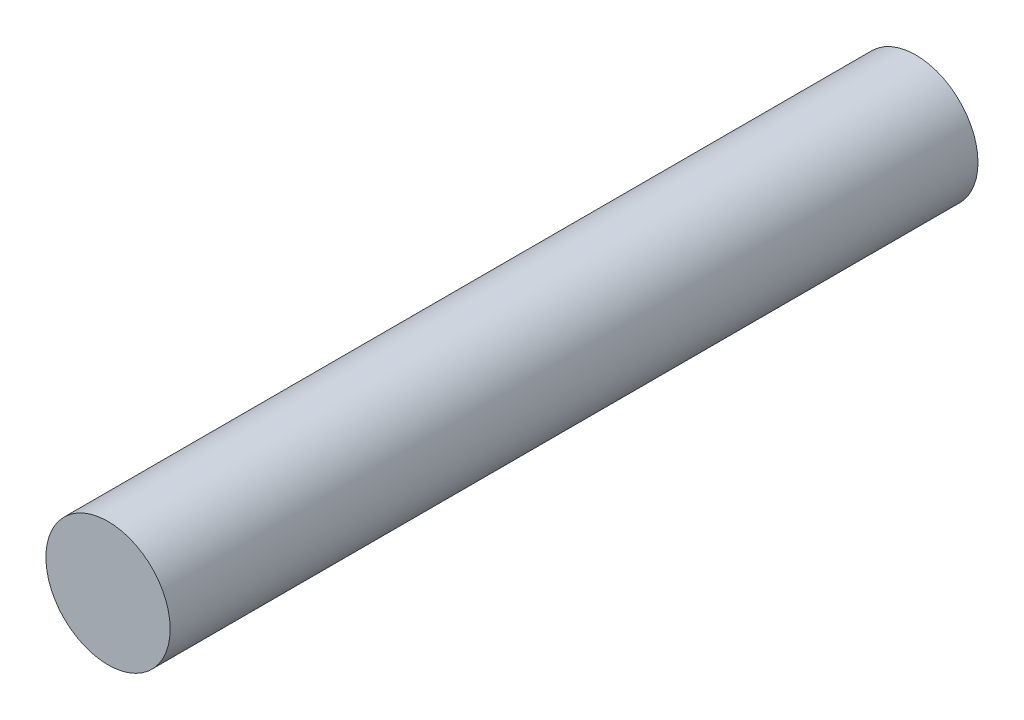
from build123d import *

# Parameters (mm, degrees)
CROQUIS1_W = 2.5
CROQUIS1_H = 32.5


with BuildPart() as part:
    # Croquis1 → Revoluci_n1 (revolve)
    with BuildSketch(Plane(origin=(0, 0, 0), x_dir=(1, 0, 0), z_dir=(0, 1, 0))):
        with Locations((1.25, -16.25)):
            Rectangle(CROQUIS1_W, CROQUIS1_H)
    revolve(axis=Axis((0, 0, 4.583290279), (0, 0, 1)))


solid = part.part
